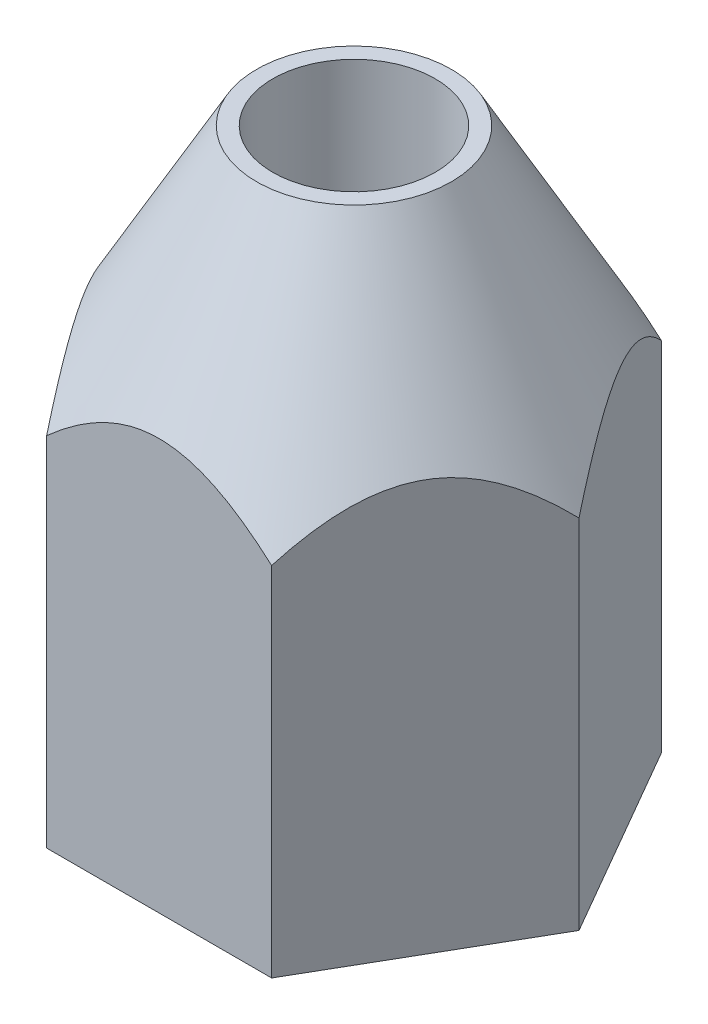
ISO-10303-21;
HEADER;
FILE_DESCRIPTION(('STEP AP214'),'2;1');
FILE_NAME('part.step','',(''),(''),'','','');
FILE_SCHEMA(('AUTOMOTIVE_DESIGN { 1 0 10303 214 1 1 1 1 }'));
ENDSEC;
DATA;
#1=APPLICATION_CONTEXT('core data for automotive mechanical design processes');
#2=APPLICATION_PROTOCOL_DEFINITION('international standard','automotive_design',2000,#1);
#3=PRODUCT_CONTEXT('',#1,'mechanical');
#4=PRODUCT('Part','Part','',(#3));
#5=PRODUCT_RELATED_PRODUCT_CATEGORY('part','',(#4));
#6=PRODUCT_DEFINITION_FORMATION('','',#4);
#7=PRODUCT_DEFINITION_CONTEXT('part definition',#1,'design');
#8=PRODUCT_DEFINITION('design','',#6,#7);
#9=PRODUCT_DEFINITION_SHAPE('','',#8);
#10=(LENGTH_UNIT() NAMED_UNIT(*) SI_UNIT(.MILLI.,.METRE.));
#11=(NAMED_UNIT(*) PLANE_ANGLE_UNIT() SI_UNIT($,.RADIAN.));
#12=(NAMED_UNIT(*) SI_UNIT($,.STERADIAN.) SOLID_ANGLE_UNIT());
#13=UNCERTAINTY_MEASURE_WITH_UNIT(LENGTH_MEASURE(1.E-05),#10,'distance_accuracy_value','');
#14=(GEOMETRIC_REPRESENTATION_CONTEXT(3) GLOBAL_UNCERTAINTY_ASSIGNED_CONTEXT((#13)) GLOBAL_UNIT_ASSIGNED_CONTEXT((#10,
#11,#12)) REPRESENTATION_CONTEXT('',''));
#15=CARTESIAN_POINT('',(0.,0.,0.));
#16=DIRECTION('',(0.,0.,1.));
#17=DIRECTION('',(1.,0.,0.));
#18=AXIS2_PLACEMENT_3D('',#15,#16,#17);
#19=CARTESIAN_POINT('',(-3.46410161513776,18.,5.99999999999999));
#20=DIRECTION('',(0.,0.,-1.));
#21=DIRECTION('',(-1.,0.,0.));
#22=AXIS2_PLACEMENT_3D('',#19,#20,#21);
#23=PLANE('',#22);
#24=DIRECTION('',(0.,-1.,0.));
#25=VECTOR('',#24,1.);
#26=CARTESIAN_POINT('',(3.46410161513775,18.,5.99999999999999));
#27=LINE('',#26,#25);
#28=CARTESIAN_POINT('',(3.46410161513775,11.,5.99999999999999));
#29=VERTEX_POINT('',#28);
#30=CARTESIAN_POINT('',(3.46410161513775,0.,5.99999999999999));
#31=VERTEX_POINT('',#30);
#32=EDGE_CURVE('E11',#29,#31,#27,.T.);
#33=ORIENTED_EDGE('',*,*,#32,.F.);
#34=CARTESIAN_POINT('',(-15.7317260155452,-6.65746855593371,5.99999999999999));
#35=CARTESIAN_POINT('',(-15.3645094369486,-6.04613018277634,5.99999999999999));
#36=CARTESIAN_POINT('',(-14.9961557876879,-5.43547033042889,5.99999999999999));
#37=CARTESIAN_POINT('',(-14.256446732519,-4.2159006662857,5.99999999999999));
#38=CARTESIAN_POINT('',(-13.8850910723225,-3.60699100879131,5.99999999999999));
#39=CARTESIAN_POINT('',(-13.1372431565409,-2.38902570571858,5.99999999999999));
#40=CARTESIAN_POINT('',(-12.7607364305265,-1.77997893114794,5.99999999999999));
#41=CARTESIAN_POINT('',(-12.0030124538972,-0.564873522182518,5.99999999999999));
#42=CARTESIAN_POINT('',(-11.6217954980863,0.0411852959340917,5.99999999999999));
#43=CARTESIAN_POINT('',(-10.8120456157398,1.31410864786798,5.99999999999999));
#44=CARTESIAN_POINT('',(-10.3828180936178,1.98053326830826,5.99999999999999));
#45=CARTESIAN_POINT('',(-9.73104129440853,2.97507445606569,5.99999999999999));
#46=CARTESIAN_POINT('',(-9.51243527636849,3.30577501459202,5.99999999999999));
#47=CARTESIAN_POINT('',(-9.07204798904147,3.96505426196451,5.99999999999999));
#48=CARTESIAN_POINT('',(-8.85026674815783,4.29363296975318,5.99999999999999));
#49=CARTESIAN_POINT('',(-8.40332122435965,4.94748202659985,5.99999999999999));
#50=CARTESIAN_POINT('',(-8.17816494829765,5.27275784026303,5.99999999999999));
#51=CARTESIAN_POINT('',(-7.72313835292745,5.91999342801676,5.99999999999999));
#52=CARTESIAN_POINT('',(-7.49326813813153,6.24195327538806,5.99999999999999));
#53=CARTESIAN_POINT('',(-7.0277025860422,6.88147196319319,5.99999999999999));
#54=CARTESIAN_POINT('',(-6.79200929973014,7.1990322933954,5.99999999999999));
#55=CARTESIAN_POINT('',(-6.31312054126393,7.82842957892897,5.99999999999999));
#56=CARTESIAN_POINT('',(-6.06992590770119,8.14026716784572,5.99999999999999));
#57=CARTESIAN_POINT('',(-5.69839936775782,8.60128325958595,5.99999999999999));
#58=CARTESIAN_POINT('',(-5.57376762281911,8.75344477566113,5.99999999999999));
#59=CARTESIAN_POINT('',(-5.32167668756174,9.05542132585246,5.99999999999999));
#60=CARTESIAN_POINT('',(-5.19421740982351,9.20523628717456,5.99999999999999));
#61=CARTESIAN_POINT('',(-4.93586162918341,9.50221567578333,5.99999999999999));
#62=CARTESIAN_POINT('',(-4.8049609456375,9.64937647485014,5.99999999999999));
#63=CARTESIAN_POINT('',(-4.53932876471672,9.94020064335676,5.99999999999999));
#64=CARTESIAN_POINT('',(-4.40459741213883,10.0838641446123,5.99999999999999));
#65=CARTESIAN_POINT('',(-4.13234481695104,10.3650625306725,5.99999999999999));
#66=CARTESIAN_POINT('',(-3.99487990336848,10.5026517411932,5.99999999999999));
#67=CARTESIAN_POINT('',(-3.71473298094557,10.772494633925,5.99999999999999));
#68=CARTESIAN_POINT('',(-3.57205002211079,10.9047473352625,5.99999999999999));
#69=CARTESIAN_POINT('',(-3.28083550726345,11.1620858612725,5.99999999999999));
#70=CARTESIAN_POINT('',(-3.13231633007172,11.2871856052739,5.99999999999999));
#71=CARTESIAN_POINT('',(-2.82813940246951,11.5283161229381,5.99999999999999));
#72=CARTESIAN_POINT('',(-2.67248544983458,11.6443516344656,5.99999999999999));
#73=CARTESIAN_POINT('',(-2.40102015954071,11.8311956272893,5.99999999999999));
#74=CARTESIAN_POINT('',(-2.28735009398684,11.9050900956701,5.99999999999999));
#75=CARTESIAN_POINT('',(-2.05563902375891,12.0456209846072,5.99999999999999));
#76=CARTESIAN_POINT('',(-1.93759731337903,12.1122562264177,5.99999999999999));
#77=CARTESIAN_POINT('',(-1.57701075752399,12.298455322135,5.99999999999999));
#78=CARTESIAN_POINT('',(-1.3271249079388,12.4049470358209,5.99999999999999));
#79=CARTESIAN_POINT('',(-0.974581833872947,12.5151994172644,5.99999999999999));
#80=CARTESIAN_POINT('',(-0.878729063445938,12.5413427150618,5.99999999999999));
#81=CARTESIAN_POINT('',(-0.685261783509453,12.5858919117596,5.99999999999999));
#82=CARTESIAN_POINT('',(-0.58764827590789,12.6043020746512,5.99999999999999));
#83=CARTESIAN_POINT('',(-0.391235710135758,12.6327579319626,5.99999999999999));
#84=CARTESIAN_POINT('',(-0.292437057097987,12.6428064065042,5.99999999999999));
#85=CARTESIAN_POINT('',(-0.094332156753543,12.6541783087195,5.99999999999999));
#86=CARTESIAN_POINT('',(0.00497409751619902,12.6555016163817,5.99999999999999));
#87=CARTESIAN_POINT('',(0.203377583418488,12.6493642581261,5.99999999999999));
#88=CARTESIAN_POINT('',(0.302474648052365,12.6418981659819,5.99999999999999));
#89=CARTESIAN_POINT('',(0.499672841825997,12.6184688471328,5.99999999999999));
#90=CARTESIAN_POINT('',(0.597773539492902,12.6025020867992,5.99999999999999));
#91=CARTESIAN_POINT('',(0.88957947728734,12.542634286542,5.99999999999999));
#92=CARTESIAN_POINT('',(1.08091129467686,12.4867608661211,5.99999999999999));
#93=CARTESIAN_POINT('',(1.41064149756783,12.3653856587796,5.99999999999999));
#94=CARTESIAN_POINT('',(1.55105891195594,12.3050884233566,5.99999999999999));
#95=CARTESIAN_POINT('',(1.82609332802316,12.1723093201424,5.99999999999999));
#96=CARTESIAN_POINT('',(1.96070652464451,12.0998196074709,5.99999999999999));
#97=CARTESIAN_POINT('',(2.22568778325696,11.9443359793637,5.99999999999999));
#98=CARTESIAN_POINT('',(2.3559910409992,11.861233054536,5.99999999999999));
#99=CARTESIAN_POINT('',(2.61119921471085,11.6872947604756,5.99999999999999));
#100=CARTESIAN_POINT('',(2.73610660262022,11.5964629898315,5.99999999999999));
#101=CARTESIAN_POINT('',(2.98340572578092,11.4069178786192,5.99999999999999));
#102=CARTESIAN_POINT('',(3.10570971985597,11.3080908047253,5.99999999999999));
#103=CARTESIAN_POINT('',(3.34601264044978,11.1053121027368,5.99999999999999));
#104=CARTESIAN_POINT('',(3.46401067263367,11.0013594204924,5.99999999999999));
#105=CARTESIAN_POINT('',(3.69633102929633,10.7892298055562,5.99999999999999));
#106=CARTESIAN_POINT('',(3.81064986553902,10.6810490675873,5.99999999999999));
#107=CARTESIAN_POINT('',(4.0359836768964,10.4612919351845,5.99999999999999));
#108=CARTESIAN_POINT('',(4.14699833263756,10.3497152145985,5.99999999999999));
#109=CARTESIAN_POINT('',(4.47689177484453,10.0095915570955,5.99999999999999));
#110=CARTESIAN_POINT('',(4.69139093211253,9.77679523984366,5.99999999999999));
#111=CARTESIAN_POINT('',(5.1112779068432,9.30341108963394,5.99999999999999));
#112=CARTESIAN_POINT('',(5.31667002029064,9.06282702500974,5.99999999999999));
#113=CARTESIAN_POINT('',(5.70159401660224,8.5984753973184,5.99999999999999));
#114=CARTESIAN_POINT('',(5.88175377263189,8.37522627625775,5.99999999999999));
#115=CARTESIAN_POINT('',(6.2373442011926,7.92495295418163,5.99999999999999));
#116=CARTESIAN_POINT('',(6.41277420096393,7.69792822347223,5.99999999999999));
#117=CARTESIAN_POINT('',(6.75761142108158,7.24367426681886,5.99999999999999));
#118=CARTESIAN_POINT('',(6.92706583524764,7.01648076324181,5.99999999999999));
#119=CARTESIAN_POINT('',(7.2626912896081,6.5597774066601,5.99999999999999));
#120=CARTESIAN_POINT('',(7.42886323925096,6.33026822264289,5.99999999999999));
#121=CARTESIAN_POINT('',(7.59371421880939,6.09982814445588,5.99999999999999));
#122=B_SPLINE_CURVE_WITH_KNOTS('',3,(#34,#35,#36,#37,#38,#39,#40,#41,#42,#43,#44,#45,#46,#47,
#48,#49,#50,#51,#52,#53,#54,#55,#56,#57,#58,#59,#60,#61,#62,#63,#64,#65,#66,#67,#68,#69,#70,#71,
#72,#73,#74,#75,#76,#77,#78,#79,#80,#81,#82,#83,#84,#85,#86,#87,#88,#89,#90,#91,#92,#93,#94,#95,
#96,#97,#98,#99,#100,#101,#102,#103,#104,#105,#106,#107,#108,#109,#110,#111,#112,#113,#114,#115,
#116,#117,#118,#119,#120,#121),.UNSPECIFIED.,.F.,.F.,(4,2,2,2,2,2,2,2,2,2,2,2,2,2,2,2,2,2,2,2,2,
2,2,2,2,2,2,2,2,2,2,2,2,2,2,2,2,2,2,2,2,2,2,4),(0.,2.13945377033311,4.2790907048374,
6.42715492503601,8.57508537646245,10.953073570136,12.1423294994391,13.3315747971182,
14.5183435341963,15.7050859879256,16.8914162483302,18.0776143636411,18.667651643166,
19.257707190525,19.8485160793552,20.4393026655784,21.0226657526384,21.6061355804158,
22.1884283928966,22.770414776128,23.1768835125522,23.5834181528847,24.3932555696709,
24.6910715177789,24.9887230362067,25.2862755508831,25.5838321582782,25.8815725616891,
26.1794368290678,26.7748015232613,27.2326548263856,27.6908038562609,28.1541076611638,
28.6171969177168,29.0887525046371,29.5604054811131,30.0324931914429,30.5046263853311,
31.4539236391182,32.4027682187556,33.2633171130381,34.1239877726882,34.974242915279,
35.8242590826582),.UNSPECIFIED.);
#123=CARTESIAN_POINT('',(-3.46410161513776,11.,5.99999999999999));
#124=VERTEX_POINT('',#123);
#125=EDGE_CURVE('E91',#29,#124,#122,.F.);
#126=ORIENTED_EDGE('',*,*,#125,.T.);
#127=DIRECTION('',(0.,-1.,0.));
#128=VECTOR('',#127,1.);
#129=CARTESIAN_POINT('',(-3.46410161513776,18.,5.99999999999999));
#130=LINE('',#129,#128);
#131=CARTESIAN_POINT('',(-3.46410161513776,0.,5.99999999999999));
#132=VERTEX_POINT('',#131);
#133=EDGE_CURVE('E57',#124,#132,#130,.T.);
#134=ORIENTED_EDGE('',*,*,#133,.T.);
#135=DIRECTION('',(1.,0.,0.));
#136=VECTOR('',#135,1.);
#137=CARTESIAN_POINT('',(-3.46410161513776,0.,5.99999999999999));
#138=LINE('',#137,#136);
#139=EDGE_CURVE('E126',#132,#31,#138,.T.);
#140=ORIENTED_EDGE('',*,*,#139,.T.);
#141=EDGE_LOOP('',(#33,#126,#134,#140));
#142=FACE_BOUND('',#141,.T.);
#143=ADVANCED_FACE('F34',(#142),#23,.F.);
#144=CARTESIAN_POINT('',(3.46410161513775,18.,5.99999999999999));
#145=DIRECTION('',(-0.866025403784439,0.,-0.5));
#146=DIRECTION('',(-0.5,0.,0.866025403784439));
#147=AXIS2_PLACEMENT_3D('',#144,#145,#146);
#148=PLANE('',#147);
#149=DIRECTION('',(0.,-1.,0.));
#150=VECTOR('',#149,1.);
#151=CARTESIAN_POINT('',(6.9282032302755,18.,0.));
#152=LINE('',#151,#150);
#153=CARTESIAN_POINT('',(6.9282032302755,11.,0.));
#154=VERTEX_POINT('',#153);
#155=CARTESIAN_POINT('',(6.9282032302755,0.,0.));
#156=VERTEX_POINT('',#155);
#157=EDGE_CURVE('E42',#154,#156,#152,.T.);
#158=ORIENTED_EDGE('',*,*,#157,.F.);
#159=CARTESIAN_POINT('',(6.92831546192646,10.9998,-0.000194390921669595));
#160=CARTESIAN_POINT('',(6.89229608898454,11.0639823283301,0.0621929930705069));
#161=CARTESIAN_POINT('',(6.85590789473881,11.1273347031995,0.1252191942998));
#162=CARTESIAN_POINT('',(6.78231050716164,11.2521445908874,0.25269360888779));
#163=CARTESIAN_POINT('',(6.74510107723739,11.3136015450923,0.317142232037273));
#164=CARTESIAN_POINT('',(6.63174337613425,11.49536931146,0.513483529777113));
#165=CARTESIAN_POINT('',(6.55425096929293,11.6123820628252,0.647704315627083));
#166=CARTESIAN_POINT('',(6.39299202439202,11.8377130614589,0.927013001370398));
#167=CARTESIAN_POINT('',(6.30911254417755,11.9457110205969,1.07229652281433));
#168=CARTESIAN_POINT('',(6.13660313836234,12.1447554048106,1.37109157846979));
#169=CARTESIAN_POINT('',(6.0479849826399,12.2358415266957,1.5245827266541));
#170=CARTESIAN_POINT('',(5.90890110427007,12.357680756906,1.76548307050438));
#171=CARTESIAN_POINT('',(5.86021423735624,12.3965936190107,1.84981119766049));
#172=CARTESIAN_POINT('',(5.76152842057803,12.4671940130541,2.02074004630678));
#173=CARTESIAN_POINT('',(5.71152936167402,12.4988809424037,2.10734095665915));
#174=CARTESIAN_POINT('',(5.61080445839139,12.5538435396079,2.28180160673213));
#175=CARTESIAN_POINT('',(5.5600874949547,12.5771837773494,2.36964596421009));
#176=CARTESIAN_POINT('',(5.45783385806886,12.6149756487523,2.54675445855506));
#177=CARTESIAN_POINT('',(5.40629734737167,12.629429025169,2.63601831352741));
#178=CARTESIAN_POINT('',(5.3022606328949,12.6489759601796,2.81621518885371));
#179=CARTESIAN_POINT('',(5.24975594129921,12.6539751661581,2.90715598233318));
#180=CARTESIAN_POINT('',(5.1447441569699,12.654112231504,3.08904172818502));
#181=CARTESIAN_POINT('',(5.09223706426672,12.649250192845,3.17998668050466));
#182=CARTESIAN_POINT('',(4.98757462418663,12.6298558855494,3.3612673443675));
#183=CARTESIAN_POINT('',(4.93542013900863,12.6153051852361,3.45160156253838));
#184=CARTESIAN_POINT('',(4.83193080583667,12.577099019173,3.63085034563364));
#185=CARTESIAN_POINT('',(4.78059647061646,12.5534380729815,3.71976402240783));
#186=CARTESIAN_POINT('',(4.66598014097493,12.4906941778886,3.91828532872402));
#187=CARTESIAN_POINT('',(4.60302733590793,12.4492085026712,4.02732278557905));
#188=CARTESIAN_POINT('',(4.47923109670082,12.3551009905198,4.24174416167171));
#189=CARTESIAN_POINT('',(4.41838890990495,12.302472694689,4.34712592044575));
#190=CARTESIAN_POINT('',(4.29865606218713,12.187734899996,4.55450929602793));
#191=CARTESIAN_POINT('',(4.23977578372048,12.125582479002,4.65649292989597));
#192=CARTESIAN_POINT('',(4.12421089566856,11.9936824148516,4.85665718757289));
#193=CARTESIAN_POINT('',(4.06752599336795,11.92393578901,4.95483831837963));
#194=CARTESIAN_POINT('',(3.96310155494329,11.7872803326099,5.135706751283));
#195=CARTESIAN_POINT('',(3.91512435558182,11.72109196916,5.21880569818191));
#196=CARTESIAN_POINT('',(3.82061156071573,11.5847204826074,5.38250666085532));
#197=CARTESIAN_POINT('',(3.77407604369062,11.5145371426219,5.46310854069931));
#198=CARTESIAN_POINT('',(3.68294803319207,11.3717930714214,5.62094688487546));
#199=CARTESIAN_POINT('',(3.63833773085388,11.2992775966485,5.69821419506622));
#200=CARTESIAN_POINT('',(3.55030640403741,11.1514925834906,5.85068892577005));
#201=CARTESIAN_POINT('',(3.50688483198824,11.076224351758,5.92589729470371));
#202=CARTESIAN_POINT('',(3.4639893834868,10.9998,6.00019439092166));
#203=B_SPLINE_CURVE_WITH_KNOTS('',3,(#159,#160,#161,#162,#163,#164,#165,#166,#167,#168,#169,
#170,#171,#172,#173,#174,#175,#176,#177,#178,#179,#180,#181,#182,#183,#184,#185,#186,#187,#188,
#189,#190,#191,#192,#193,#194,#195,#196,#197,#198,#199,#200,#201,#202),.UNSPECIFIED.,.F.,.F.,(4,
2,2,2,2,2,2,2,2,2,2,2,2,2,2,2,2,2,2,2,2,4),(0.,0.289435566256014,0.578955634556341,
1.16110464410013,1.75898075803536,2.3554352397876,2.66978627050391,2.98416350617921,
3.29605324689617,3.60788180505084,3.92280631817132,4.23772757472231,4.55324965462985,
4.86896184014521,5.26601182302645,5.66329259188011,6.06241950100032,6.46149300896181,
6.81108334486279,7.16069267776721,7.50555198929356,7.85024967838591),.UNSPECIFIED.);
#204=EDGE_CURVE('E86',#154,#29,#203,.T.);
#205=ORIENTED_EDGE('',*,*,#204,.T.);
#206=ORIENTED_EDGE('',*,*,#32,.T.);
#207=DIRECTION('',(0.5,0.,-0.866025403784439));
#208=VECTOR('',#207,1.);
#209=CARTESIAN_POINT('',(3.46410161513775,0.,5.99999999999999));
#210=LINE('',#209,#208);
#211=EDGE_CURVE('E106',#31,#156,#210,.T.);
#212=ORIENTED_EDGE('',*,*,#211,.T.);
#213=EDGE_LOOP('',(#158,#205,#206,#212));
#214=FACE_BOUND('',#213,.T.);
#215=ADVANCED_FACE('F104',(#214),#148,.F.);
#216=CARTESIAN_POINT('',(6.9282032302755,18.,0.));
#217=DIRECTION('',(-0.866025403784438,0.,0.5));
#218=DIRECTION('',(0.5,0.,0.866025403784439));
#219=AXIS2_PLACEMENT_3D('',#216,#217,#218);
#220=PLANE('',#219);
#221=DIRECTION('',(0.,-1.,0.));
#222=VECTOR('',#221,1.);
#223=CARTESIAN_POINT('',(3.46410161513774,18.,-6.));
#224=LINE('',#223,#222);
#225=CARTESIAN_POINT('',(3.46410161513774,11.,-6.));
#226=VERTEX_POINT('',#225);
#227=CARTESIAN_POINT('',(3.46410161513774,0.,-6.));
#228=VERTEX_POINT('',#227);
#229=EDGE_CURVE('E101',#226,#228,#224,.T.);
#230=ORIENTED_EDGE('',*,*,#229,.F.);
#231=CARTESIAN_POINT('',(3.4639893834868,10.9998,-6.00019439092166));
#232=CARTESIAN_POINT('',(3.50000875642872,11.0639823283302,-5.93780700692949));
#233=CARTESIAN_POINT('',(3.53639695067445,11.1273347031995,-5.87478080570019));
#234=CARTESIAN_POINT('',(3.60999433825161,11.2521445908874,-5.7473063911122));
#235=CARTESIAN_POINT('',(3.64720376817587,11.3136015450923,-5.68285776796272));
#236=CARTESIAN_POINT('',(3.76056146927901,11.49536931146,-5.48651647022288));
#237=CARTESIAN_POINT('',(3.83805387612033,11.6123820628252,-5.35229568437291));
#238=CARTESIAN_POINT('',(3.99931282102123,11.8377130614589,-5.07298699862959));
#239=CARTESIAN_POINT('',(4.0831923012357,11.9457110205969,-4.92770347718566));
#240=CARTESIAN_POINT('',(4.25570170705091,12.1447554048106,-4.6289084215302));
#241=CARTESIAN_POINT('',(4.34431986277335,12.2358415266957,-4.47541727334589));
#242=CARTESIAN_POINT('',(4.48340374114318,12.357680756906,-4.23451692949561));
#243=CARTESIAN_POINT('',(4.53209060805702,12.3965936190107,-4.15018880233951));
#244=CARTESIAN_POINT('',(4.63077642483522,12.4671940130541,-3.97925995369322));
#245=CARTESIAN_POINT('',(4.68077548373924,12.4988809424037,-3.89265904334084));
#246=CARTESIAN_POINT('',(4.78150038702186,12.5538435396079,-3.71819839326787));
#247=CARTESIAN_POINT('',(4.83221735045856,12.5771837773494,-3.6303540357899));
#248=CARTESIAN_POINT('',(4.93447098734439,12.6149756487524,-3.45324554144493));
#249=CARTESIAN_POINT('',(4.98600749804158,12.629429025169,-3.36398168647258));
#250=CARTESIAN_POINT('',(5.09004421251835,12.6489759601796,-3.18378481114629));
#251=CARTESIAN_POINT('',(5.14254890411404,12.6539751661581,-3.09284401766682));
#252=CARTESIAN_POINT('',(5.24756068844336,12.654112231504,-2.91095827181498));
#253=CARTESIAN_POINT('',(5.30006778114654,12.649250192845,-2.82001331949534));
#254=CARTESIAN_POINT('',(5.40473022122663,12.6298558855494,-2.63873265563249));
#255=CARTESIAN_POINT('',(5.45688470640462,12.6153051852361,-2.54839843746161));
#256=CARTESIAN_POINT('',(5.56037403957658,12.577099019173,-2.36914965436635));
#257=CARTESIAN_POINT('',(5.6117083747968,12.5534380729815,-2.28023597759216));
#258=CARTESIAN_POINT('',(5.72632470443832,12.4906941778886,-2.08171467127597));
#259=CARTESIAN_POINT('',(5.78927750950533,12.4492085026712,-1.97267721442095));
#260=CARTESIAN_POINT('',(5.91307374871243,12.3551009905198,-1.75825583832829));
#261=CARTESIAN_POINT('',(5.9739159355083,12.302472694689,-1.65287407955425));
#262=CARTESIAN_POINT('',(6.09364878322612,12.187734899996,-1.44549070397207));
#263=CARTESIAN_POINT('',(6.15252906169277,12.125582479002,-1.34350707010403));
#264=CARTESIAN_POINT('',(6.26809394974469,11.9936824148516,-1.14334281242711));
#265=CARTESIAN_POINT('',(6.3247788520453,11.92393578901,-1.04516168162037));
#266=CARTESIAN_POINT('',(6.42920329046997,11.7872803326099,-0.864293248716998));
#267=CARTESIAN_POINT('',(6.47718048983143,11.72109196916,-0.781194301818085));
#268=CARTESIAN_POINT('',(6.57169328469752,11.5847204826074,-0.617493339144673));
#269=CARTESIAN_POINT('',(6.61822880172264,11.5145371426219,-0.536891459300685));
#270=CARTESIAN_POINT('',(6.70935681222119,11.3717930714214,-0.37905311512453));
#271=CARTESIAN_POINT('',(6.75396711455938,11.2992775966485,-0.301785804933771));
#272=CARTESIAN_POINT('',(6.84199844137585,11.1514925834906,-0.149311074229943));
#273=CARTESIAN_POINT('',(6.88542001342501,11.076224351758,-0.0741027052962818));
#274=CARTESIAN_POINT('',(6.92831546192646,10.9998,0.000194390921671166));
#275=B_SPLINE_CURVE_WITH_KNOTS('',3,(#231,#232,#233,#234,#235,#236,#237,#238,#239,#240,#241,
#242,#243,#244,#245,#246,#247,#248,#249,#250,#251,#252,#253,#254,#255,#256,#257,#258,#259,#260,
#261,#262,#263,#264,#265,#266,#267,#268,#269,#270,#271,#272,#273,#274),.UNSPECIFIED.,.F.,.F.,(4,
2,2,2,2,2,2,2,2,2,2,2,2,2,2,2,2,2,2,2,2,4),(0.,0.289435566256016,0.578955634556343,
1.16110464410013,1.75898075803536,2.3554352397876,2.66978627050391,2.9841635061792,
3.29605324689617,3.60788180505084,3.92280631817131,4.23772757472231,4.55324965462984,
4.8689618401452,5.26601182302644,5.6632925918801,6.06241950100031,6.46149300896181,
6.81108334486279,7.16069267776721,7.50555198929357,7.85024967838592),.UNSPECIFIED.);
#276=EDGE_CURVE('E89',#226,#154,#275,.T.);
#277=ORIENTED_EDGE('',*,*,#276,.T.);
#278=ORIENTED_EDGE('',*,*,#157,.T.);
#279=DIRECTION('',(-0.5,0.,-0.866025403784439));
#280=VECTOR('',#279,1.);
#281=CARTESIAN_POINT('',(6.9282032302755,0.,0.));
#282=LINE('',#281,#280);
#283=EDGE_CURVE('E123',#156,#228,#282,.T.);
#284=ORIENTED_EDGE('',*,*,#283,.T.);
#285=EDGE_LOOP('',(#230,#277,#278,#284));
#286=FACE_BOUND('',#285,.T.);
#287=ADVANCED_FACE('F98',(#286),#220,.F.);
#288=CARTESIAN_POINT('',(3.46410161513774,18.,-6.));
#289=DIRECTION('',(0.,0.,1.));
#290=DIRECTION('',(1.,0.,0.));
#291=AXIS2_PLACEMENT_3D('',#288,#289,#290);
#292=PLANE('',#291);
#293=DIRECTION('',(0.,-1.,0.));
#294=VECTOR('',#293,1.);
#295=CARTESIAN_POINT('',(-3.46410161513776,18.,-6.));
#296=LINE('',#295,#294);
#297=CARTESIAN_POINT('',(-3.46410161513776,11.,-5.99999999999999));
#298=VERTEX_POINT('',#297);
#299=CARTESIAN_POINT('',(-3.46410161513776,0.,-6.));
#300=VERTEX_POINT('',#299);
#301=EDGE_CURVE('E108',#298,#300,#296,.T.);
#302=ORIENTED_EDGE('',*,*,#301,.F.);
#303=CARTESIAN_POINT('',(-15.7317260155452,-6.65746855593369,-6.));
#304=CARTESIAN_POINT('',(-15.3645094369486,-6.04613018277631,-6.));
#305=CARTESIAN_POINT('',(-14.9961557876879,-5.43547033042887,-6.));
#306=CARTESIAN_POINT('',(-14.256446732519,-4.21590066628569,-6.));
#307=CARTESIAN_POINT('',(-13.8850910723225,-3.6069910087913,-6.));
#308=CARTESIAN_POINT('',(-13.1372431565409,-2.38902570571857,-6.));
#309=CARTESIAN_POINT('',(-12.7607364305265,-1.77997893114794,-6.));
#310=CARTESIAN_POINT('',(-12.0030124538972,-0.56487352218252,-6.));
#311=CARTESIAN_POINT('',(-11.6217954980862,0.0411852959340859,-6.));
#312=CARTESIAN_POINT('',(-10.8120456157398,1.31410864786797,-6.));
#313=CARTESIAN_POINT('',(-10.3828180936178,1.98053326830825,-6.));
#314=CARTESIAN_POINT('',(-9.73104129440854,2.97507445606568,-6.));
#315=CARTESIAN_POINT('',(-9.5124352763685,3.30577501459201,-6.));
#316=CARTESIAN_POINT('',(-9.07204798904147,3.96505426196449,-6.));
#317=CARTESIAN_POINT('',(-8.85026674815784,4.29363296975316,-6.));
#318=CARTESIAN_POINT('',(-8.40332122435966,4.94748202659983,-6.));
#319=CARTESIAN_POINT('',(-8.17816494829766,5.27275784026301,-6.));
#320=CARTESIAN_POINT('',(-7.72313835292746,5.91999342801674,-6.));
#321=CARTESIAN_POINT('',(-7.49326813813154,6.24195327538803,-6.));
#322=CARTESIAN_POINT('',(-7.02770258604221,6.88147196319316,-6.));
#323=CARTESIAN_POINT('',(-6.79200929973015,7.19903229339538,-6.));
#324=CARTESIAN_POINT('',(-6.31312054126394,7.82842957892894,-6.));
#325=CARTESIAN_POINT('',(-6.06992590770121,8.14026716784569,-6.));
#326=CARTESIAN_POINT('',(-5.69839936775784,8.60128325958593,-6.));
#327=CARTESIAN_POINT('',(-5.57376762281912,8.75344477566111,-6.));
#328=CARTESIAN_POINT('',(-5.32167668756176,9.05542132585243,-6.));
#329=CARTESIAN_POINT('',(-5.19421740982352,9.20523628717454,-6.));
#330=CARTESIAN_POINT('',(-4.93586162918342,9.50221567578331,-6.));
#331=CARTESIAN_POINT('',(-4.80496094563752,9.64937647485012,-6.));
#332=CARTESIAN_POINT('',(-4.53932876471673,9.94020064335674,-6.));
#333=CARTESIAN_POINT('',(-4.40459741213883,10.0838641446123,-6.));
#334=CARTESIAN_POINT('',(-4.13234481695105,10.3650625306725,-6.));
#335=CARTESIAN_POINT('',(-3.99487990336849,10.5026517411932,-6.));
#336=CARTESIAN_POINT('',(-3.71473298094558,10.7724946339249,-6.));
#337=CARTESIAN_POINT('',(-3.57205002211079,10.9047473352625,-6.));
#338=CARTESIAN_POINT('',(-3.28083550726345,11.1620858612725,-6.));
#339=CARTESIAN_POINT('',(-3.13231633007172,11.2871856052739,-6.));
#340=CARTESIAN_POINT('',(-2.8281394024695,11.5283161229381,-6.));
#341=CARTESIAN_POINT('',(-2.67248544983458,11.6443516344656,-6.));
#342=CARTESIAN_POINT('',(-2.4010201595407,11.8311956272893,-6.));
#343=CARTESIAN_POINT('',(-2.28735009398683,11.9050900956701,-6.));
#344=CARTESIAN_POINT('',(-2.0556390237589,12.0456209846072,-6.));
#345=CARTESIAN_POINT('',(-1.93759731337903,12.1122562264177,-6.));
#346=CARTESIAN_POINT('',(-1.57701075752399,12.298455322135,-6.));
#347=CARTESIAN_POINT('',(-1.3271249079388,12.4049470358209,-6.));
#348=CARTESIAN_POINT('',(-0.974581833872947,12.5151994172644,-6.));
#349=CARTESIAN_POINT('',(-0.878729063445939,12.5413427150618,-6.));
#350=CARTESIAN_POINT('',(-0.685261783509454,12.5858919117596,-6.));
#351=CARTESIAN_POINT('',(-0.58764827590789,12.6043020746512,-6.));
#352=CARTESIAN_POINT('',(-0.391235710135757,12.6327579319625,-6.));
#353=CARTESIAN_POINT('',(-0.292437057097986,12.6428064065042,-6.));
#354=CARTESIAN_POINT('',(-0.0943321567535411,12.6541783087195,-6.));
#355=CARTESIAN_POINT('',(0.00497409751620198,12.6555016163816,-6.));
#356=CARTESIAN_POINT('',(0.203377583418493,12.6493642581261,-6.));
#357=CARTESIAN_POINT('',(0.30247464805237,12.6418981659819,-6.));
#358=CARTESIAN_POINT('',(0.499672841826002,12.6184688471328,-6.));
#359=CARTESIAN_POINT('',(0.597773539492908,12.6025020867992,-6.));
#360=CARTESIAN_POINT('',(0.889579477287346,12.5426342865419,-6.));
#361=CARTESIAN_POINT('',(1.08091129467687,12.4867608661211,-6.));
#362=CARTESIAN_POINT('',(1.41064149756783,12.3653856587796,-6.));
#363=CARTESIAN_POINT('',(1.55105891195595,12.3050884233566,-6.));
#364=CARTESIAN_POINT('',(1.82609332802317,12.1723093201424,-6.));
#365=CARTESIAN_POINT('',(1.96070652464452,12.0998196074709,-6.));
#366=CARTESIAN_POINT('',(2.22568778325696,11.9443359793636,-6.));
#367=CARTESIAN_POINT('',(2.35599104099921,11.861233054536,-6.));
#368=CARTESIAN_POINT('',(2.61119921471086,11.6872947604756,-6.));
#369=CARTESIAN_POINT('',(2.73610660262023,11.5964629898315,-6.));
#370=CARTESIAN_POINT('',(2.98340572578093,11.4069178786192,-6.));
#371=CARTESIAN_POINT('',(3.10570971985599,11.3080908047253,-6.));
#372=CARTESIAN_POINT('',(3.34601264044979,11.1053121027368,-6.));
#373=CARTESIAN_POINT('',(3.46401067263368,11.0013594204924,-6.));
#374=CARTESIAN_POINT('',(3.69633102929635,10.7892298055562,-6.));
#375=CARTESIAN_POINT('',(3.81064986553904,10.6810490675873,-6.));
#376=CARTESIAN_POINT('',(4.03598367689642,10.4612919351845,-6.));
#377=CARTESIAN_POINT('',(4.14699833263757,10.3497152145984,-6.));
#378=CARTESIAN_POINT('',(4.47689177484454,10.0095915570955,-6.));
#379=CARTESIAN_POINT('',(4.69139093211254,9.77679523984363,-6.));
#380=CARTESIAN_POINT('',(5.11127790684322,9.30341108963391,-6.));
#381=CARTESIAN_POINT('',(5.31667002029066,9.0628270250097,-6.));
#382=CARTESIAN_POINT('',(5.70159401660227,8.59847539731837,-6.));
#383=CARTESIAN_POINT('',(5.88175377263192,8.37522627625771,-6.));
#384=CARTESIAN_POINT('',(6.23734420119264,7.92495295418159,-6.));
#385=CARTESIAN_POINT('',(6.41277420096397,7.69792822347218,-6.));
#386=CARTESIAN_POINT('',(6.75761142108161,7.24367426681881,-6.));
#387=CARTESIAN_POINT('',(6.92706583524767,7.01648076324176,-6.));
#388=CARTESIAN_POINT('',(7.26269128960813,6.55977740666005,-6.));
#389=CARTESIAN_POINT('',(7.42886323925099,6.33026822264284,-6.));
#390=CARTESIAN_POINT('',(7.59371421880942,6.09982814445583,-6.));
#391=B_SPLINE_CURVE_WITH_KNOTS('',3,(#303,#304,#305,#306,#307,#308,#309,#310,#311,#312,#313,
#314,#315,#316,#317,#318,#319,#320,#321,#322,#323,#324,#325,#326,#327,#328,#329,#330,#331,#332,
#333,#334,#335,#336,#337,#338,#339,#340,#341,#342,#343,#344,#345,#346,#347,#348,#349,#350,#351,
#352,#353,#354,#355,#356,#357,#358,#359,#360,#361,#362,#363,#364,#365,#366,#367,#368,#369,#370,
#371,#372,#373,#374,#375,#376,#377,#378,#379,#380,#381,#382,#383,#384,#385,#386,#387,#388,#389,
#390),.UNSPECIFIED.,.F.,.F.,(4,2,2,2,2,2,2,2,2,2,2,2,2,2,2,2,2,2,2,2,2,2,2,2,2,2,2,2,2,2,2,2,2,
2,2,2,2,2,2,2,2,2,2,4),(0.,2.1394537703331,4.27909070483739,6.42715492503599,8.57508537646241,
10.953073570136,12.142329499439,13.3315747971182,14.5183435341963,15.7050859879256,
16.8914162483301,18.0776143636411,18.667651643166,19.257707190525,19.8485160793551,
20.4393026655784,21.0226657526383,21.6061355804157,22.1884283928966,22.770414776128,
23.1768835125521,23.5834181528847,24.3932555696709,24.6910715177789,24.9887230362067,
25.2862755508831,25.5838321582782,25.8815725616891,26.1794368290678,26.7748015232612,
27.2326548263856,27.6908038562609,28.1541076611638,28.6171969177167,29.088752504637,
29.5604054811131,30.0324931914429,30.5046263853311,31.4539236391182,32.4027682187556,
33.2633171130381,34.1239877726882,34.974242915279,35.8242590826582),.UNSPECIFIED.);
#392=EDGE_CURVE('E102',#298,#226,#391,.T.);
#393=ORIENTED_EDGE('',*,*,#392,.T.);
#394=ORIENTED_EDGE('',*,*,#229,.T.);
#395=DIRECTION('',(-1.,0.,0.));
#396=VECTOR('',#395,1.);
#397=CARTESIAN_POINT('',(3.46410161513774,0.,-6.));
#398=LINE('',#397,#396);
#399=EDGE_CURVE('E120',#228,#300,#398,.T.);
#400=ORIENTED_EDGE('',*,*,#399,.T.);
#401=EDGE_LOOP('',(#302,#393,#394,#400));
#402=FACE_BOUND('',#401,.T.);
#403=ADVANCED_FACE('F173',(#402),#292,.F.);
#404=CARTESIAN_POINT('',(-3.46410161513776,18.,-6.));
#405=DIRECTION('',(0.866025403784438,0.,0.5));
#406=DIRECTION('',(0.5,0.,-0.866025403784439));
#407=AXIS2_PLACEMENT_3D('',#404,#405,#406);
#408=PLANE('',#407);
#409=DIRECTION('',(0.,-1.,0.));
#410=VECTOR('',#409,1.);
#411=CARTESIAN_POINT('',(-6.92820323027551,18.,0.));
#412=LINE('',#411,#410);
#413=CARTESIAN_POINT('',(-6.92820323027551,11.,0.));
#414=VERTEX_POINT('',#413);
#415=CARTESIAN_POINT('',(-6.92820323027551,0.,0.));
#416=VERTEX_POINT('',#415);
#417=EDGE_CURVE('E112',#414,#416,#412,.T.);
#418=ORIENTED_EDGE('',*,*,#417,.F.);
#419=CARTESIAN_POINT('',(-6.92831546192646,10.9998,0.000194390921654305));
#420=CARTESIAN_POINT('',(-6.89229608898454,11.0639823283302,-0.0621929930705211));
#421=CARTESIAN_POINT('',(-6.85590789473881,11.1273347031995,-0.125219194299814));
#422=CARTESIAN_POINT('',(-6.78231050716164,11.2521445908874,-0.252693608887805));
#423=CARTESIAN_POINT('',(-6.74510107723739,11.3136015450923,-0.317142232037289));
#424=CARTESIAN_POINT('',(-6.63174337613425,11.49536931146,-0.51348352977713));
#425=CARTESIAN_POINT('',(-6.55425096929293,11.6123820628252,-0.6477043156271));
#426=CARTESIAN_POINT('',(-6.39299202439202,11.8377130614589,-0.927013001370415));
#427=CARTESIAN_POINT('',(-6.30911254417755,11.9457110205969,-1.07229652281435));
#428=CARTESIAN_POINT('',(-6.13660313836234,12.1447554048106,-1.37109157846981));
#429=CARTESIAN_POINT('',(-6.0479849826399,12.2358415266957,-1.52458272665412));
#430=CARTESIAN_POINT('',(-5.90890110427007,12.357680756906,-1.7654830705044));
#431=CARTESIAN_POINT('',(-5.86021423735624,12.3965936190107,-1.84981119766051));
#432=CARTESIAN_POINT('',(-5.76152842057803,12.4671940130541,-2.0207400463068));
#433=CARTESIAN_POINT('',(-5.71152936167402,12.4988809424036,-2.10734095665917));
#434=CARTESIAN_POINT('',(-5.61080445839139,12.5538435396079,-2.28180160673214));
#435=CARTESIAN_POINT('',(-5.5600874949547,12.5771837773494,-2.36964596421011));
#436=CARTESIAN_POINT('',(-5.45783385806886,12.6149756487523,-2.54675445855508));
#437=CARTESIAN_POINT('',(-5.40629734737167,12.6294290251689,-2.63601831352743));
#438=CARTESIAN_POINT('',(-5.3022606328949,12.6489759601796,-2.81621518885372));
#439=CARTESIAN_POINT('',(-5.24975594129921,12.6539751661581,-2.90715598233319));
#440=CARTESIAN_POINT('',(-5.1447441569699,12.654112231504,-3.08904172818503));
#441=CARTESIAN_POINT('',(-5.09223706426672,12.649250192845,-3.17998668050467));
#442=CARTESIAN_POINT('',(-4.98757462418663,12.6298558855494,-3.36126734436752));
#443=CARTESIAN_POINT('',(-4.93542013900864,12.6153051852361,-3.4516015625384));
#444=CARTESIAN_POINT('',(-4.83193080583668,12.577099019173,-3.63085034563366));
#445=CARTESIAN_POINT('',(-4.78059647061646,12.5534380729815,-3.71976402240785));
#446=CARTESIAN_POINT('',(-4.66598014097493,12.4906941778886,-3.91828532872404));
#447=CARTESIAN_POINT('',(-4.60302733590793,12.4492085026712,-4.02732278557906));
#448=CARTESIAN_POINT('',(-4.47923109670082,12.3551009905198,-4.24174416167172));
#449=CARTESIAN_POINT('',(-4.41838890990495,12.302472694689,-4.34712592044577));
#450=CARTESIAN_POINT('',(-4.29865606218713,12.187734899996,-4.55450929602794));
#451=CARTESIAN_POINT('',(-4.23977578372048,12.125582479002,-4.65649292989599));
#452=CARTESIAN_POINT('',(-4.12421089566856,11.9936824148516,-4.85665718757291));
#453=CARTESIAN_POINT('',(-4.06752599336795,11.92393578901,-4.95483831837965));
#454=CARTESIAN_POINT('',(-3.96310155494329,11.7872803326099,-5.13570675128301));
#455=CARTESIAN_POINT('',(-3.91512435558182,11.72109196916,-5.21880569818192));
#456=CARTESIAN_POINT('',(-3.82061156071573,11.5847204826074,-5.38250666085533));
#457=CARTESIAN_POINT('',(-3.77407604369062,11.5145371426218,-5.46310854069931));
#458=CARTESIAN_POINT('',(-3.68294803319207,11.3717930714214,-5.62094688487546));
#459=CARTESIAN_POINT('',(-3.63833773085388,11.2992775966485,-5.69821419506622));
#460=CARTESIAN_POINT('',(-3.55030640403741,11.1514925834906,-5.85068892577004));
#461=CARTESIAN_POINT('',(-3.50688483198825,11.076224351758,-5.9258972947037));
#462=CARTESIAN_POINT('',(-3.46398938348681,10.9998,-6.00019439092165));
#463=B_SPLINE_CURVE_WITH_KNOTS('',3,(#419,#420,#421,#422,#423,#424,#425,#426,#427,#428,#429,
#430,#431,#432,#433,#434,#435,#436,#437,#438,#439,#440,#441,#442,#443,#444,#445,#446,#447,#448,
#449,#450,#451,#452,#453,#454,#455,#456,#457,#458,#459,#460,#461,#462),.UNSPECIFIED.,.F.,.F.,(4,
2,2,2,2,2,2,2,2,2,2,2,2,2,2,2,2,2,2,2,2,4),(0.,0.289435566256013,0.578955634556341,
1.16110464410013,1.75898075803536,2.3554352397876,2.66978627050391,2.98416350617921,
3.29605324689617,3.60788180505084,3.92280631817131,4.2377275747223,4.55324965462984,
4.8689618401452,5.26601182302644,5.66329259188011,6.06241950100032,6.46149300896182,
6.81108334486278,7.16069267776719,7.50555198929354,7.85024967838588),.UNSPECIFIED.);
#464=EDGE_CURVE('E49',#414,#298,#463,.T.);
#465=ORIENTED_EDGE('',*,*,#464,.T.);
#466=ORIENTED_EDGE('',*,*,#301,.T.);
#467=DIRECTION('',(-0.5,0.,0.866025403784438));
#468=VECTOR('',#467,1.);
#469=CARTESIAN_POINT('',(-3.46410161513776,0.,-6.));
#470=LINE('',#469,#468);
#471=EDGE_CURVE('E117',#300,#416,#470,.T.);
#472=ORIENTED_EDGE('',*,*,#471,.T.);
#473=EDGE_LOOP('',(#418,#465,#466,#472));
#474=FACE_BOUND('',#473,.T.);
#475=ADVANCED_FACE('F216',(#474),#408,.F.);
#476=CARTESIAN_POINT('',(-6.92820323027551,18.,0.));
#477=DIRECTION('',(0.866025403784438,0.,-0.5));
#478=DIRECTION('',(-0.5,0.,-0.866025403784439));
#479=AXIS2_PLACEMENT_3D('',#476,#477,#478);
#480=PLANE('',#479);
#481=ORIENTED_EDGE('',*,*,#133,.F.);
#482=CARTESIAN_POINT('',(-3.46398938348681,10.9998,6.00019439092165));
#483=CARTESIAN_POINT('',(-3.50000875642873,11.0639823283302,5.93780700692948));
#484=CARTESIAN_POINT('',(-3.53639695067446,11.1273347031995,5.87478080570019));
#485=CARTESIAN_POINT('',(-3.60999433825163,11.2521445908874,5.74730639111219));
#486=CARTESIAN_POINT('',(-3.64720376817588,11.3136015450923,5.68285776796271));
#487=CARTESIAN_POINT('',(-3.76056146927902,11.49536931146,5.48651647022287));
#488=CARTESIAN_POINT('',(-3.83805387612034,11.6123820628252,5.3522956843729));
#489=CARTESIAN_POINT('',(-3.99931282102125,11.8377130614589,5.07298699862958));
#490=CARTESIAN_POINT('',(-4.08319230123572,11.9457110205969,4.92770347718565));
#491=CARTESIAN_POINT('',(-4.25570170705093,12.1447554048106,4.62890842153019));
#492=CARTESIAN_POINT('',(-4.34431986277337,12.2358415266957,4.47541727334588));
#493=CARTESIAN_POINT('',(-4.4834037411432,12.357680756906,4.2345169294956));
#494=CARTESIAN_POINT('',(-4.53209060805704,12.3965936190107,4.15018880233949));
#495=CARTESIAN_POINT('',(-4.63077642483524,12.4671940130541,3.9792599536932));
#496=CARTESIAN_POINT('',(-4.68077548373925,12.4988809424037,3.89265904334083));
#497=CARTESIAN_POINT('',(-4.78150038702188,12.5538435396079,3.71819839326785));
#498=CARTESIAN_POINT('',(-4.83221735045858,12.5771837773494,3.63035403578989));
#499=CARTESIAN_POINT('',(-4.93447098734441,12.6149756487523,3.45324554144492));
#500=CARTESIAN_POINT('',(-4.9860074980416,12.6294290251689,3.36398168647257));
#501=CARTESIAN_POINT('',(-5.09004421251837,12.6489759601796,3.18378481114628));
#502=CARTESIAN_POINT('',(-5.14254890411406,12.6539751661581,3.09284401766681));
#503=CARTESIAN_POINT('',(-5.24756068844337,12.654112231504,2.91095827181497));
#504=CARTESIAN_POINT('',(-5.30006778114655,12.649250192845,2.82001331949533));
#505=CARTESIAN_POINT('',(-5.40473022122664,12.6298558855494,2.63873265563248));
#506=CARTESIAN_POINT('',(-5.45688470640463,12.6153051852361,2.5483984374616));
#507=CARTESIAN_POINT('',(-5.5603740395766,12.577099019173,2.36914965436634));
#508=CARTESIAN_POINT('',(-5.61170837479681,12.5534380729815,2.28023597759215));
#509=CARTESIAN_POINT('',(-5.72632470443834,12.4906941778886,2.08171467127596));
#510=CARTESIAN_POINT('',(-5.78927750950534,12.4492085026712,1.97267721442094));
#511=CARTESIAN_POINT('',(-5.91307374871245,12.3551009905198,1.75825583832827));
#512=CARTESIAN_POINT('',(-5.97391593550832,12.302472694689,1.65287407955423));
#513=CARTESIAN_POINT('',(-6.09364878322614,12.187734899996,1.44549070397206));
#514=CARTESIAN_POINT('',(-6.1525290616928,12.125582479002,1.34350707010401));
#515=CARTESIAN_POINT('',(-6.26809394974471,11.9936824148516,1.14334281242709));
#516=CARTESIAN_POINT('',(-6.32477885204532,11.92393578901,1.04516168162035));
#517=CARTESIAN_POINT('',(-6.42920329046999,11.7872803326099,0.864293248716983));
#518=CARTESIAN_POINT('',(-6.47718048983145,11.72109196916,0.781194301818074));
#519=CARTESIAN_POINT('',(-6.57169328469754,11.5847204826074,0.617493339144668));
#520=CARTESIAN_POINT('',(-6.61822880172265,11.5145371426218,0.536891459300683));
#521=CARTESIAN_POINT('',(-6.7093568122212,11.3717930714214,0.379053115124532));
#522=CARTESIAN_POINT('',(-6.75396711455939,11.2992775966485,0.301785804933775));
#523=CARTESIAN_POINT('',(-6.84199844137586,11.1514925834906,0.149311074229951));
#524=CARTESIAN_POINT('',(-6.88542001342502,11.076224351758,0.0741027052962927));
#525=CARTESIAN_POINT('',(-6.92831546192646,10.9998,-0.000194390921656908));
#526=B_SPLINE_CURVE_WITH_KNOTS('',3,(#482,#483,#484,#485,#486,#487,#488,#489,#490,#491,#492,
#493,#494,#495,#496,#497,#498,#499,#500,#501,#502,#503,#504,#505,#506,#507,#508,#509,#510,#511,
#512,#513,#514,#515,#516,#517,#518,#519,#520,#521,#522,#523,#524,#525),.UNSPECIFIED.,.F.,.F.,(4,
2,2,2,2,2,2,2,2,2,2,2,2,2,2,2,2,2,2,2,2,4),(0.,0.289435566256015,0.578955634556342,
1.16110464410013,1.75898075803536,2.3554352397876,2.66978627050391,2.98416350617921,
3.29605324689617,3.60788180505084,3.92280631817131,4.23772757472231,4.55324965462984,
4.8689618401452,5.26601182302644,5.66329259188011,6.06241950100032,6.46149300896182,
6.81108334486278,7.1606926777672,7.50555198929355,7.85024967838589),.UNSPECIFIED.);
#527=EDGE_CURVE('E148',#124,#414,#526,.T.);
#528=ORIENTED_EDGE('',*,*,#527,.T.);
#529=ORIENTED_EDGE('',*,*,#417,.T.);
#530=DIRECTION('',(0.5,0.,0.866025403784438));
#531=VECTOR('',#530,1.);
#532=CARTESIAN_POINT('',(-6.92820323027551,0.,0.));
#533=LINE('',#532,#531);
#534=EDGE_CURVE('E115',#416,#132,#533,.T.);
#535=ORIENTED_EDGE('',*,*,#534,.T.);
#536=EDGE_LOOP('',(#481,#528,#529,#535));
#537=FACE_BOUND('',#536,.T.);
#538=ADVANCED_FACE('F212',(#537),#480,.F.);
#539=CARTESIAN_POINT('',(0.,0.,0.));
#540=DIRECTION('',(0.,1.,0.));
#541=DIRECTION('',(0.,0.,1.));
#542=AXIS2_PLACEMENT_3D('',#539,#540,#541);
#543=PLANE('',#542);
#544=CARTESIAN_POINT('',(0.,0.,0.));
#545=DIRECTION('',(0.,-1.,0.));
#546=DIRECTION('',(1.,0.,0.));
#547=AXIS2_PLACEMENT_3D('',#544,#545,#546);
#548=CIRCLE('',#547,4.);
#549=CARTESIAN_POINT('',(4.,0.,0.));
#550=VERTEX_POINT('',#549);
#551=EDGE_CURVE('E205',#550,#550,#548,.T.);
#552=ORIENTED_EDGE('',*,*,#551,.F.);
#553=EDGE_LOOP('',(#552));
#554=FACE_BOUND('',#553,.T.);
#555=ORIENTED_EDGE('',*,*,#139,.F.);
#556=ORIENTED_EDGE('',*,*,#534,.F.);
#557=ORIENTED_EDGE('',*,*,#471,.F.);
#558=ORIENTED_EDGE('',*,*,#399,.F.);
#559=ORIENTED_EDGE('',*,*,#283,.F.);
#560=ORIENTED_EDGE('',*,*,#211,.F.);
#561=EDGE_LOOP('',(#555,#556,#557,#558,#559,#560));
#562=FACE_BOUND('',#561,.T.);
#563=ADVANCED_FACE('F140',(#554,#562),#543,.F.);
#564=CARTESIAN_POINT('',(0.,18.,0.));
#565=DIRECTION('',(0.,-1.,0.));
#566=DIRECTION('',(1.,0.,0.));
#567=AXIS2_PLACEMENT_3D('',#564,#565,#566);
#568=CONICAL_SURFACE('',#567,3.,0.511379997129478);
#569=CARTESIAN_POINT('',(0.,18.,0.));
#570=DIRECTION('',(0.,-1.,0.));
#571=DIRECTION('',(1.,0.,0.));
#572=AXIS2_PLACEMENT_3D('',#569,#570,#571);
#573=CIRCLE('',#572,3.);
#574=CARTESIAN_POINT('',(3.,18.,0.));
#575=VERTEX_POINT('',#574);
#576=EDGE_CURVE('E191',#575,#575,#573,.T.);
#577=ORIENTED_EDGE('',*,*,#576,.T.);
#578=EDGE_LOOP('',(#577));
#579=FACE_BOUND('',#578,.T.);
#580=ORIENTED_EDGE('',*,*,#204,.F.);
#581=ORIENTED_EDGE('',*,*,#276,.F.);
#582=ORIENTED_EDGE('',*,*,#392,.F.);
#583=ORIENTED_EDGE('',*,*,#464,.F.);
#584=ORIENTED_EDGE('',*,*,#527,.F.);
#585=ORIENTED_EDGE('',*,*,#125,.F.);
#586=EDGE_LOOP('',(#580,#581,#582,#583,#584,#585));
#587=FACE_BOUND('',#586,.T.);
#588=ADVANCED_FACE('F88',(#579,#587),#568,.T.);
#589=CARTESIAN_POINT('',(0.,18.,0.));
#590=DIRECTION('',(0.,1.,0.));
#591=DIRECTION('',(0.,0.,1.));
#592=AXIS2_PLACEMENT_3D('',#589,#590,#591);
#593=PLANE('',#592);
#594=CARTESIAN_POINT('',(0.,18.,0.));
#595=DIRECTION('',(0.,-1.,0.));
#596=DIRECTION('',(1.,0.,0.));
#597=AXIS2_PLACEMENT_3D('',#594,#595,#596);
#598=CIRCLE('',#597,2.5);
#599=CARTESIAN_POINT('',(2.5,18.,0.));
#600=VERTEX_POINT('',#599);
#601=EDGE_CURVE('E194',#600,#600,#598,.T.);
#602=ORIENTED_EDGE('',*,*,#601,.T.);
#603=EDGE_LOOP('',(#602));
#604=FACE_BOUND('',#603,.T.);
#605=ORIENTED_EDGE('',*,*,#576,.F.);
#606=EDGE_LOOP('',(#605));
#607=FACE_BOUND('',#606,.T.);
#608=ADVANCED_FACE('F139',(#604,#607),#593,.T.);
#609=CARTESIAN_POINT('',(0.,0.,0.));
#610=DIRECTION('',(0.,-1.,0.));
#611=DIRECTION('',(1.,0.,0.));
#612=AXIS2_PLACEMENT_3D('',#609,#610,#611);
#613=CYLINDRICAL_SURFACE('',#612,2.5);
#614=ORIENTED_EDGE('',*,*,#601,.F.);
#615=EDGE_LOOP('',(#614));
#616=FACE_BOUND('',#615,.T.);
#617=CARTESIAN_POINT('',(0.,12.2975641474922,0.));
#618=DIRECTION('',(0.,-1.,0.));
#619=DIRECTION('',(1.,0.,0.));
#620=AXIS2_PLACEMENT_3D('',#617,#618,#619);
#621=CIRCLE('',#620,2.5);
#622=CARTESIAN_POINT('',(2.5,12.2975641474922,0.));
#623=VERTEX_POINT('',#622);
#624=EDGE_CURVE('E197',#623,#623,#621,.T.);
#625=ORIENTED_EDGE('',*,*,#624,.T.);
#626=EDGE_LOOP('',(#625));
#627=FACE_BOUND('',#626,.T.);
#628=ADVANCED_FACE('F142',(#616,#627),#613,.F.);
#629=CARTESIAN_POINT('',(0.,11.5,0.));
#630=DIRECTION('',(0.,-1.,0.));
#631=DIRECTION('',(1.,0.,0.));
#632=AXIS2_PLACEMENT_3D('',#629,#630,#631);
#633=CONICAL_SURFACE('',#632,4.,1.08210413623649);
#634=ORIENTED_EDGE('',*,*,#624,.F.);
#635=EDGE_LOOP('',(#634));
#636=FACE_BOUND('',#635,.T.);
#637=CARTESIAN_POINT('',(0.,11.5,0.));
#638=DIRECTION('',(0.,-1.,0.));
#639=DIRECTION('',(1.,0.,0.));
#640=AXIS2_PLACEMENT_3D('',#637,#638,#639);
#641=CIRCLE('',#640,4.);
#642=CARTESIAN_POINT('',(4.,11.5,0.));
#643=VERTEX_POINT('',#642);
#644=EDGE_CURVE('E202',#643,#643,#641,.T.);
#645=ORIENTED_EDGE('',*,*,#644,.T.);
#646=EDGE_LOOP('',(#645));
#647=FACE_BOUND('',#646,.T.);
#648=ADVANCED_FACE('F274',(#636,#647),#633,.F.);
#649=CARTESIAN_POINT('',(0.,0.,0.));
#650=DIRECTION('',(0.,-1.,0.));
#651=DIRECTION('',(1.,0.,0.));
#652=AXIS2_PLACEMENT_3D('',#649,#650,#651);
#653=CYLINDRICAL_SURFACE('',#652,4.);
#654=ORIENTED_EDGE('',*,*,#644,.F.);
#655=EDGE_LOOP('',(#654));
#656=FACE_BOUND('',#655,.T.);
#657=ORIENTED_EDGE('',*,*,#551,.T.);
#658=EDGE_LOOP('',(#657));
#659=FACE_BOUND('',#658,.T.);
#660=ADVANCED_FACE('F209',(#656,#659),#653,.F.);
#661=CLOSED_SHELL('',(#143,#215,#287,#403,#475,#538,#563,#588,#608,#628,#648,#660));
#662=MANIFOLD_SOLID_BREP('B2',#661);
#663=ADVANCED_BREP_SHAPE_REPRESENTATION('',(#18,#662),#14);
#664=SHAPE_DEFINITION_REPRESENTATION(#9,#663);
ENDSEC;
END-ISO-10303-21;
